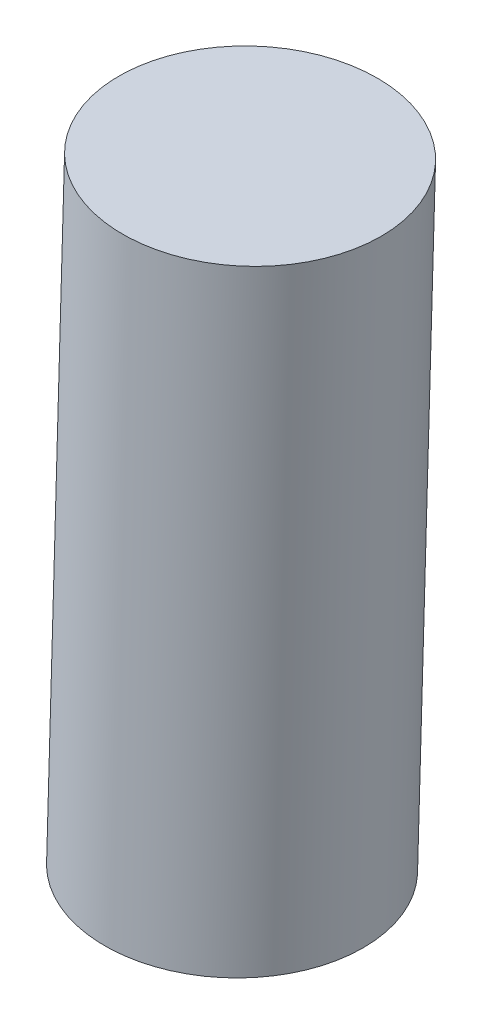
from build123d import *


with BuildPart() as part:
    # Esquisse1 → R_volution1 (revolve)
    with BuildSketch(Plane.XY.offset(-92.992140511)):
        Polygon((-217.223211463, -5.388036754), (-224.22031322, -5.186624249), (-225.180339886, -38.538100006), (-218.183238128, -38.739512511), align=None)
    revolve(axis=Axis((-224.214520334, -4.985378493, -92.992140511), (-0.028773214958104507, -0.9995859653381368, 0)))


solid = part.part
